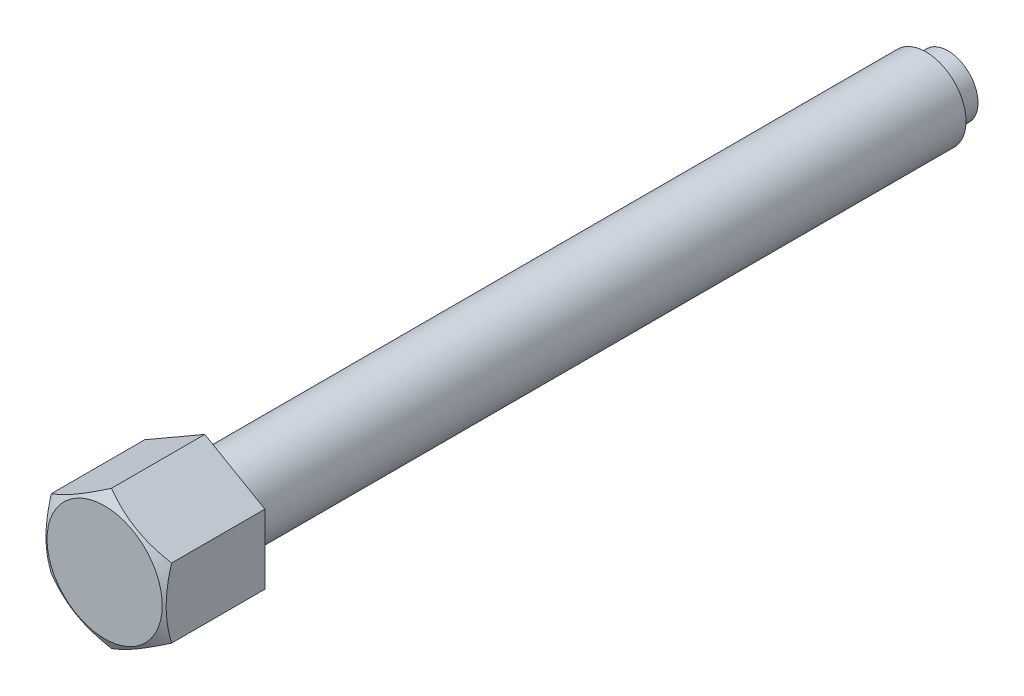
ISO-10303-21;
HEADER;
FILE_DESCRIPTION(('STEP AP214'),'2;1');
FILE_NAME('part.step','',(''),(''),'','','');
FILE_SCHEMA(('AUTOMOTIVE_DESIGN { 1 0 10303 214 1 1 1 1 }'));
ENDSEC;
DATA;
#1=APPLICATION_CONTEXT('core data for automotive mechanical design processes');
#2=APPLICATION_PROTOCOL_DEFINITION('international standard','automotive_design',2000,#1);
#3=PRODUCT_CONTEXT('',#1,'mechanical');
#4=PRODUCT('Part','Part','',(#3));
#5=PRODUCT_RELATED_PRODUCT_CATEGORY('part','',(#4));
#6=PRODUCT_DEFINITION_FORMATION('','',#4);
#7=PRODUCT_DEFINITION_CONTEXT('part definition',#1,'design');
#8=PRODUCT_DEFINITION('design','',#6,#7);
#9=PRODUCT_DEFINITION_SHAPE('','',#8);
#10=(LENGTH_UNIT() NAMED_UNIT(*) SI_UNIT(.MILLI.,.METRE.));
#11=(NAMED_UNIT(*) PLANE_ANGLE_UNIT() SI_UNIT($,.RADIAN.));
#12=(NAMED_UNIT(*) SI_UNIT($,.STERADIAN.) SOLID_ANGLE_UNIT());
#13=UNCERTAINTY_MEASURE_WITH_UNIT(LENGTH_MEASURE(1.E-05),#10,'distance_accuracy_value','');
#14=(GEOMETRIC_REPRESENTATION_CONTEXT(3) GLOBAL_UNCERTAINTY_ASSIGNED_CONTEXT((#13)) GLOBAL_UNIT_ASSIGNED_CONTEXT((#10,
#11,#12)) REPRESENTATION_CONTEXT('',''));
#15=CARTESIAN_POINT('',(0.,0.,0.));
#16=DIRECTION('',(0.,0.,1.));
#17=DIRECTION('',(1.,0.,0.));
#18=AXIS2_PLACEMENT_3D('',#15,#16,#17);
#19=CARTESIAN_POINT('',(0.,13.856406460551,150.));
#20=DIRECTION('',(-0.5,-0.86602540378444,0.));
#21=DIRECTION('',(0.86602540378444,-0.5,0.));
#22=AXIS2_PLACEMENT_3D('',#19,#20,#21);
#23=PLANE('',#22);
#24=CARTESIAN_POINT('',(12.0002,6.92808776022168,168.639461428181));
#25=CARTESIAN_POINT('',(11.7364142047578,7.08038456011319,168.727375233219));
#26=CARTESIAN_POINT('',(11.4716448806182,7.2332492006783,168.811298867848));
#27=CARTESIAN_POINT('',(10.9399829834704,7.54020434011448,168.970058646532));
#28=CARTESIAN_POINT('',(10.673089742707,7.69429522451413,169.044891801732));
#29=CARTESIAN_POINT('',(9.86810959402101,8.15905073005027,169.254307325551));
#30=CARTESIAN_POINT('',(9.32684492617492,8.47155003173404,169.373421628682));
#31=CARTESIAN_POINT('',(8.51686717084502,8.93919090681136,169.513093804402));
#32=CARTESIAN_POINT('',(8.25057389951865,9.09293539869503,169.552881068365));
#33=CARTESIAN_POINT('',(7.71675440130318,9.4011362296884,169.619601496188));
#34=CARTESIAN_POINT('',(7.44922815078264,9.55559258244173,169.646534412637));
#35=CARTESIAN_POINT('',(6.91372963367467,9.86476279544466,169.686856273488));
#36=CARTESIAN_POINT('',(6.64575827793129,10.0194761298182,169.700261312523));
#37=CARTESIAN_POINT('',(6.10956726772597,10.3290461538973,169.713241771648));
#38=CARTESIAN_POINT('',(5.84134762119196,10.4839028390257,169.712817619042));
#39=CARTESIAN_POINT('',(5.33991062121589,10.7734076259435,169.699104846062));
#40=CARTESIAN_POINT('',(5.10665750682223,10.908076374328,169.687488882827));
#41=CARTESIAN_POINT('',(4.64068775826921,11.1771041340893,169.654016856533));
#42=CARTESIAN_POINT('',(4.40797116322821,11.3114631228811,169.632160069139));
#43=CARTESIAN_POINT('',(3.94320092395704,11.5797983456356,169.578587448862));
#44=CARTESIAN_POINT('',(3.71114798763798,11.7137741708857,169.546863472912));
#45=CARTESIAN_POINT('',(3.248130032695,11.9810977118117,169.474113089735));
#46=CARTESIAN_POINT('',(3.01716508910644,12.1144453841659,169.433086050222));
#47=CARTESIAN_POINT('',(2.31605804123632,12.5192297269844,169.295013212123));
#48=CARTESIAN_POINT('',(1.84794625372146,12.789494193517,169.184199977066));
#49=CARTESIAN_POINT('',(0.918702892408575,13.3259930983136,168.932699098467));
#50=CARTESIAN_POINT('',(0.457559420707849,13.5922344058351,168.792070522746));
#51=CARTESIAN_POINT('',(-0.000199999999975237,13.8565219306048,168.639461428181));
#52=B_SPLINE_CURVE_WITH_KNOTS('',3,(#24,#25,#26,#27,#28,#29,#30,#31,#32,#33,#34,#35,#36,#37,#38,
#39,#40,#41,#42,#43,#44,#45,#46,#47,#48,#49,#50,#51),.UNSPECIFIED.,.F.,.F.,(4,2,2,2,2,2,2,2,2,2,
2,2,2,4),(0.,0.951004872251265,1.90232158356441,3.80900466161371,4.73894551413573,
5.66890426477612,6.59775529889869,7.52657763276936,8.33514643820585,9.14377244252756,
9.95306755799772,10.7624176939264,12.4167102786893,14.0677556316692),.UNSPECIFIED.);
#53=CARTESIAN_POINT('',(12.,6.92820323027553,168.639528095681));
#54=VERTEX_POINT('',#53);
#55=CARTESIAN_POINT('',(0.,13.856406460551,168.639528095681));
#56=VERTEX_POINT('',#55);
#57=EDGE_CURVE('E29',#54,#56,#52,.T.);
#58=ORIENTED_EDGE('',*,*,#57,.F.);
#59=DIRECTION('',(0.,0.,1.));
#60=VECTOR('',#59,1.);
#61=CARTESIAN_POINT('',(12.,6.92820323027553,150.));
#62=LINE('',#61,#60);
#63=CARTESIAN_POINT('',(12.,6.92820323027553,150.));
#64=VERTEX_POINT('',#63);
#65=EDGE_CURVE('E22',#64,#54,#62,.T.);
#66=ORIENTED_EDGE('',*,*,#65,.F.);
#67=DIRECTION('',(0.86602540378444,-0.5,0.));
#68=VECTOR('',#67,1.);
#69=CARTESIAN_POINT('',(0.,13.856406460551,150.));
#70=LINE('',#69,#68);
#71=CARTESIAN_POINT('',(0.,13.856406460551,150.));
#72=VERTEX_POINT('',#71);
#73=EDGE_CURVE('E37',#72,#64,#70,.T.);
#74=ORIENTED_EDGE('',*,*,#73,.F.);
#75=DIRECTION('',(0.,0.,1.));
#76=VECTOR('',#75,1.);
#77=CARTESIAN_POINT('',(0.,13.856406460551,150.));
#78=LINE('',#77,#76);
#79=EDGE_CURVE('E87',#72,#56,#78,.T.);
#80=ORIENTED_EDGE('',*,*,#79,.T.);
#81=EDGE_LOOP('',(#58,#66,#74,#80));
#82=FACE_BOUND('',#81,.T.);
#83=ADVANCED_FACE('F14',(#82),#23,.F.);
#84=CARTESIAN_POINT('',(12.,6.92820323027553,150.));
#85=DIRECTION('',(-1.,0.,0.));
#86=DIRECTION('',(0.,0.,1.));
#87=AXIS2_PLACEMENT_3D('',#84,#85,#86);
#88=PLANE('',#87);
#89=CARTESIAN_POINT('',(12.,-18.6520842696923,163.834577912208));
#90=CARTESIAN_POINT('',(12.,-18.3898551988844,163.961899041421));
#91=CARTESIAN_POINT('',(12.,-18.1273195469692,164.088588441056));
#92=CARTESIAN_POINT('',(12.,-17.6015711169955,164.340560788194));
#93=CARTESIAN_POINT('',(12.,-17.3383583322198,164.465843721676));
#94=CARTESIAN_POINT('',(12.,-16.5475388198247,164.839401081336));
#95=CARTESIAN_POINT('',(12.,-16.0188278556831,165.085346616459));
#96=CARTESIAN_POINT('',(12.,-14.9550247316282,165.570863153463));
#97=CARTESIAN_POINT('',(12.,-14.4199135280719,165.810392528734));
#98=CARTESIAN_POINT('',(12.,-13.3454502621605,166.279708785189));
#99=CARTESIAN_POINT('',(12.,-12.8060984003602,166.509496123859));
#100=CARTESIAN_POINT('',(12.,-11.7047322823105,166.96399971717));
#101=CARTESIAN_POINT('',(12.,-11.1425498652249,167.18831059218));
#102=CARTESIAN_POINT('',(12.,-10.011619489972,167.620058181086));
#103=CARTESIAN_POINT('',(12.,-9.44287080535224,167.827493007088));
#104=CARTESIAN_POINT('',(12.,-8.2989724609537,168.220070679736));
#105=CARTESIAN_POINT('',(12.,-7.72383828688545,168.405258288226));
#106=CARTESIAN_POINT('',(12.,-6.56526555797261,168.747437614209));
#107=CARTESIAN_POINT('',(12.,-5.98182966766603,168.904438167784));
#108=CARTESIAN_POINT('',(12.,-5.10195783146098,169.112709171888));
#109=CARTESIAN_POINT('',(12.,-4.80869223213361,169.177453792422));
#110=CARTESIAN_POINT('',(12.,-4.22014933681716,169.297098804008));
#111=CARTESIAN_POINT('',(12.,-3.92487208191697,169.351999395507));
#112=CARTESIAN_POINT('',(12.,-3.33250640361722,169.450989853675));
#113=CARTESIAN_POINT('',(12.,-3.03541800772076,169.495079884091));
#114=CARTESIAN_POINT('',(12.,-2.4397414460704,169.571571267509));
#115=CARTESIAN_POINT('',(12.,-2.14115333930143,169.603973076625));
#116=CARTESIAN_POINT('',(12.,-1.54681202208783,169.656035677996));
#117=CARTESIAN_POINT('',(12.,-1.25107306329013,169.675858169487));
#118=CARTESIAN_POINT('',(12.,-0.659022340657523,169.702976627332));
#119=CARTESIAN_POINT('',(12.,-0.362710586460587,169.71027280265));
#120=CARTESIAN_POINT('',(12.,0.229956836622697,169.712164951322));
#121=CARTESIAN_POINT('',(12.,0.526312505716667,169.706760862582));
#122=CARTESIAN_POINT('',(12.,1.11853118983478,169.683384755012));
#123=CARTESIAN_POINT('',(12.,1.414394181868,169.66541216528));
#124=CARTESIAN_POINT('',(12.,2.12415362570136,169.6076032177));
#125=CARTESIAN_POINT('',(12.,2.537578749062,169.561875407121));
#126=CARTESIAN_POINT('',(12.,3.36139101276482,169.448358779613));
#127=CARTESIAN_POINT('',(12.,3.77177773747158,169.380566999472));
#128=CARTESIAN_POINT('',(12.,4.58911091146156,169.225333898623));
#129=CARTESIAN_POINT('',(12.,4.99605445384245,169.137877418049));
#130=CARTESIAN_POINT('',(12.,5.80587435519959,168.945985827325));
#131=CARTESIAN_POINT('',(12.,6.20875077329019,168.84155096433));
#132=CARTESIAN_POINT('',(12.,7.01935985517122,168.615760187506));
#133=CARTESIAN_POINT('',(12.,7.42700152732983,168.494079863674));
#134=CARTESIAN_POINT('',(12.,8.23826948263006,168.238066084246));
#135=CARTESIAN_POINT('',(12.,8.64189573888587,168.103732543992));
#136=CARTESIAN_POINT('',(12.,9.44533138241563,167.824552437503));
#137=CARTESIAN_POINT('',(12.,9.84514196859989,167.679709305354));
#138=CARTESIAN_POINT('',(12.,10.641444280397,167.381222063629));
#139=CARTESIAN_POINT('',(12.,11.0379360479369,167.227578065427));
#140=CARTESIAN_POINT('',(12.,11.9857392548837,166.85012020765));
#141=CARTESIAN_POINT('',(12.,12.535647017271,166.622786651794));
#142=CARTESIAN_POINT('',(12.,13.630687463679,166.156862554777));
#143=CARTESIAN_POINT('',(12.,14.1758198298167,165.918271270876));
#144=CARTESIAN_POINT('',(12.,15.2622189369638,165.432126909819));
#145=CARTESIAN_POINT('',(12.,15.8034847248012,165.184571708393));
#146=CARTESIAN_POINT('',(12.,16.8826792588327,164.682341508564));
#147=CARTESIAN_POINT('',(12.,17.4206080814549,164.427666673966));
#148=CARTESIAN_POINT('',(12.,18.4943077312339,163.912255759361));
#149=CARTESIAN_POINT('',(12.,19.0300753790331,163.651513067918));
#150=CARTESIAN_POINT('',(12.,20.0992834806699,163.125299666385));
#151=CARTESIAN_POINT('',(12.,20.6327239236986,162.859828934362));
#152=CARTESIAN_POINT('',(12.,21.6975680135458,162.325018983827));
#153=CARTESIAN_POINT('',(12.,22.2289719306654,162.055680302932));
#154=CARTESIAN_POINT('',(12.,23.2901146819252,161.513740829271));
#155=CARTESIAN_POINT('',(12.,23.8198535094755,161.241140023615));
#156=CARTESIAN_POINT('',(12.,25.3159236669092,160.466375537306));
#157=CARTESIAN_POINT('',(12.,26.2805978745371,159.961012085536));
#158=CARTESIAN_POINT('',(12.,28.2063891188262,158.943481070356));
#159=CARTESIAN_POINT('',(12.,29.1675060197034,158.431313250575));
#160=CARTESIAN_POINT('',(12.,31.0844738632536,157.403112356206));
#161=CARTESIAN_POINT('',(12.,32.0403319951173,156.887092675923));
#162=CARTESIAN_POINT('',(12.,33.472447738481,156.110051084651));
#163=CARTESIAN_POINT('',(12.,33.9495276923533,155.850542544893));
#164=CARTESIAN_POINT('',(12.,34.9031943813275,155.330622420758));
#165=CARTESIAN_POINT('',(12.,35.3797811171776,155.070210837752));
#166=CARTESIAN_POINT('',(12.,35.8561494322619,154.809400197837));
#167=B_SPLINE_CURVE_WITH_KNOTS('',3,(#89,#90,#91,#92,#93,#94,#95,#96,#97,#98,#99,#100,#101,#102,
#103,#104,#105,#106,#107,#108,#109,#110,#111,#112,#113,#114,#115,#116,#117,#118,#119,#120,#121,
#122,#123,#124,#125,#126,#127,#128,#129,#130,#131,#132,#133,#134,#135,#136,#137,#138,#139,#140,
#141,#142,#143,#144,#145,#146,#147,#148,#149,#150,#151,#152,#153,#154,#155,#156,#157,#158,#159,
#160,#161,#162,#163,#164,#165,#166),.UNSPECIFIED.,.F.,.F.,(4,2,2,2,2,2,2,2,2,2,2,2,2,2,2,2,2,2,
2,2,2,2,2,2,2,2,2,2,2,2,2,2,2,2,2,2,2,2,4),(0.,0.874511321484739,1.74903135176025,
3.49832805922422,5.25707723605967,7.01574373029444,8.83137823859,10.6472155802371,
12.4593359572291,14.2708872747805,15.1717311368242,16.0725566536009,16.973368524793,
17.8741452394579,18.7630950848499,19.6520301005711,20.5409694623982,21.4299492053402,
22.6770991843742,23.9244167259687,25.1726991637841,26.4209634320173,27.6969627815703,
28.9729706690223,30.2485634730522,31.5241401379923,33.3091044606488,35.0941867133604,
36.8796947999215,38.6651618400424,40.4526749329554,42.2401963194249,44.0274716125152,
45.814753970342,49.0818057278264,52.3489809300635,55.6077204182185,57.2369985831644,
58.8662742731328),.UNSPECIFIED.);
#168=CARTESIAN_POINT('',(12.,-6.92820323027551,168.639528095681));
#169=VERTEX_POINT('',#168);
#170=EDGE_CURVE('E103',#169,#54,#167,.T.);
#171=ORIENTED_EDGE('',*,*,#170,.F.);
#172=DIRECTION('',(0.,0.,1.));
#173=VECTOR('',#172,1.);
#174=CARTESIAN_POINT('',(12.,-6.9282032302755,150.));
#175=LINE('',#174,#173);
#176=CARTESIAN_POINT('',(12.,-6.9282032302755,150.));
#177=VERTEX_POINT('',#176);
#178=EDGE_CURVE('E96',#177,#169,#175,.T.);
#179=ORIENTED_EDGE('',*,*,#178,.F.);
#180=DIRECTION('',(0.,-1.,0.));
#181=VECTOR('',#180,1.);
#182=CARTESIAN_POINT('',(12.,6.92820323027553,150.));
#183=LINE('',#182,#181);
#184=EDGE_CURVE('E105',#64,#177,#183,.T.);
#185=ORIENTED_EDGE('',*,*,#184,.F.);
#186=ORIENTED_EDGE('',*,*,#65,.T.);
#187=EDGE_LOOP('',(#171,#179,#185,#186));
#188=FACE_BOUND('',#187,.T.);
#189=ADVANCED_FACE('F102',(#188),#88,.F.);
#190=CARTESIAN_POINT('',(0.,-13.856406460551,150.));
#191=DIRECTION('',(0.5,-0.866025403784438,0.));
#192=DIRECTION('',(0.866025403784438,0.5,0.));
#193=AXIS2_PLACEMENT_3D('',#190,#191,#192);
#194=PLANE('',#193);
#195=ORIENTED_EDGE('',*,*,#178,.T.);
#196=CARTESIAN_POINT('',(12.0002,-6.92808776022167,168.639461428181));
#197=CARTESIAN_POINT('',(11.7364142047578,-7.08038456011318,168.727375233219));
#198=CARTESIAN_POINT('',(11.4716448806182,-7.23324920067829,168.811298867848));
#199=CARTESIAN_POINT('',(10.9399829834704,-7.54020434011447,168.970058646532));
#200=CARTESIAN_POINT('',(10.673089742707,-7.69429522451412,169.044891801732));
#201=CARTESIAN_POINT('',(9.86810959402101,-8.15905073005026,169.254307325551));
#202=CARTESIAN_POINT('',(9.32684492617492,-8.47155003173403,169.373421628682));
#203=CARTESIAN_POINT('',(8.51686717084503,-8.93919090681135,169.513093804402));
#204=CARTESIAN_POINT('',(8.25057389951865,-9.09293539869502,169.552881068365));
#205=CARTESIAN_POINT('',(7.71675440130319,-9.4011362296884,169.619601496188));
#206=CARTESIAN_POINT('',(7.44922815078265,-9.55559258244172,169.646534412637));
#207=CARTESIAN_POINT('',(6.91372963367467,-9.86476279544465,169.686856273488));
#208=CARTESIAN_POINT('',(6.64575827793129,-10.0194761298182,169.700261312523));
#209=CARTESIAN_POINT('',(6.10956726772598,-10.3290461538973,169.713241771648));
#210=CARTESIAN_POINT('',(5.84134762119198,-10.4839028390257,169.712817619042));
#211=CARTESIAN_POINT('',(5.3399106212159,-10.7734076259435,169.699104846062));
#212=CARTESIAN_POINT('',(5.10665750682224,-10.908076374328,169.687488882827));
#213=CARTESIAN_POINT('',(4.64068775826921,-11.1771041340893,169.654016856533));
#214=CARTESIAN_POINT('',(4.40797116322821,-11.3114631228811,169.632160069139));
#215=CARTESIAN_POINT('',(3.94320092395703,-11.5797983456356,169.578587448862));
#216=CARTESIAN_POINT('',(3.71114798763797,-11.7137741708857,169.546863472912));
#217=CARTESIAN_POINT('',(3.24813003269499,-11.9810977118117,169.474113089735));
#218=CARTESIAN_POINT('',(3.01716508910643,-12.1144453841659,169.433086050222));
#219=CARTESIAN_POINT('',(2.31605804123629,-12.5192297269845,169.295013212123));
#220=CARTESIAN_POINT('',(1.84794625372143,-12.789494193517,169.184199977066));
#221=CARTESIAN_POINT('',(0.91870289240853,-13.3259930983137,168.932699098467));
#222=CARTESIAN_POINT('',(0.457559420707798,-13.5922344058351,168.792070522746));
#223=CARTESIAN_POINT('',(-0.000200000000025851,-13.8565219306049,168.639461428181));
#224=B_SPLINE_CURVE_WITH_KNOTS('',3,(#196,#197,#198,#199,#200,#201,#202,#203,#204,#205,#206,
#207,#208,#209,#210,#211,#212,#213,#214,#215,#216,#217,#218,#219,#220,#221,#222,#223),
.UNSPECIFIED.,.F.,.F.,(4,2,2,2,2,2,2,2,2,2,2,2,2,4),(0.,0.951004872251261,1.9023215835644,
3.80900466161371,4.73894551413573,5.66890426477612,6.59775529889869,7.52657763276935,
8.33514643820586,9.14377244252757,9.95306755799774,10.7624176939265,12.4167102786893,
14.0677556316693),.UNSPECIFIED.);
#225=CARTESIAN_POINT('',(0.,-13.856406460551,168.639528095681));
#226=VERTEX_POINT('',#225);
#227=EDGE_CURVE('E107',#169,#226,#224,.T.);
#228=ORIENTED_EDGE('',*,*,#227,.T.);
#229=DIRECTION('',(0.,0.,1.));
#230=VECTOR('',#229,1.);
#231=CARTESIAN_POINT('',(0.,-13.856406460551,150.));
#232=LINE('',#231,#230);
#233=CARTESIAN_POINT('',(0.,-13.856406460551,150.));
#234=VERTEX_POINT('',#233);
#235=EDGE_CURVE('E89',#234,#226,#232,.T.);
#236=ORIENTED_EDGE('',*,*,#235,.F.);
#237=DIRECTION('',(0.866025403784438,0.5,0.));
#238=VECTOR('',#237,1.);
#239=CARTESIAN_POINT('',(0.,-13.856406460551,150.));
#240=LINE('',#239,#238);
#241=EDGE_CURVE('E298',#234,#177,#240,.T.);
#242=ORIENTED_EDGE('',*,*,#241,.T.);
#243=EDGE_LOOP('',(#195,#228,#236,#242));
#244=FACE_BOUND('',#243,.T.);
#245=ADVANCED_FACE('F160',(#244),#194,.T.);
#246=CARTESIAN_POINT('',(0.,-13.856406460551,150.));
#247=DIRECTION('',(0.5,0.866025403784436,0.));
#248=DIRECTION('',(-0.866025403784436,0.5,0.));
#249=AXIS2_PLACEMENT_3D('',#246,#247,#248);
#250=PLANE('',#249);
#251=CARTESIAN_POINT('',(-12.0002,-6.92808776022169,168.639461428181));
#252=CARTESIAN_POINT('',(-11.7364142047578,-7.08038456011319,168.727375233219));
#253=CARTESIAN_POINT('',(-11.4716448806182,-7.23324920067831,168.811298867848));
#254=CARTESIAN_POINT('',(-10.9399829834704,-7.54020434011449,168.970058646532));
#255=CARTESIAN_POINT('',(-10.673089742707,-7.69429522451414,169.044891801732));
#256=CARTESIAN_POINT('',(-9.86810959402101,-8.15905073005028,169.254307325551));
#257=CARTESIAN_POINT('',(-9.32684492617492,-8.47155003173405,169.373421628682));
#258=CARTESIAN_POINT('',(-8.51686717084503,-8.93919090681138,169.513093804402));
#259=CARTESIAN_POINT('',(-8.25057389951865,-9.09293539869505,169.552881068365));
#260=CARTESIAN_POINT('',(-7.71675440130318,-9.40113622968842,169.619601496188));
#261=CARTESIAN_POINT('',(-7.44922815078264,-9.55559258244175,169.646534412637));
#262=CARTESIAN_POINT('',(-6.91372963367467,-9.86476279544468,169.686856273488));
#263=CARTESIAN_POINT('',(-6.64575827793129,-10.0194761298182,169.700261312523));
#264=CARTESIAN_POINT('',(-6.10956726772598,-10.3290461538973,169.713241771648));
#265=CARTESIAN_POINT('',(-5.84134762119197,-10.4839028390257,169.712817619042));
#266=CARTESIAN_POINT('',(-5.3399106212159,-10.7734076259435,169.699104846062));
#267=CARTESIAN_POINT('',(-5.10665750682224,-10.908076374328,169.687488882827));
#268=CARTESIAN_POINT('',(-4.64068775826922,-11.1771041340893,169.654016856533));
#269=CARTESIAN_POINT('',(-4.40797116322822,-11.3114631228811,169.632160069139));
#270=CARTESIAN_POINT('',(-3.94320092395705,-11.5797983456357,169.578587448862));
#271=CARTESIAN_POINT('',(-3.71114798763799,-11.7137741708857,169.546863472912));
#272=CARTESIAN_POINT('',(-3.24813003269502,-11.9810977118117,169.474113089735));
#273=CARTESIAN_POINT('',(-3.01716508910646,-12.1144453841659,169.433086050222));
#274=CARTESIAN_POINT('',(-2.31605804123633,-12.5192297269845,169.295013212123));
#275=CARTESIAN_POINT('',(-1.84794625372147,-12.789494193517,169.184199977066));
#276=CARTESIAN_POINT('',(-0.918702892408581,-13.3259930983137,168.932699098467));
#277=CARTESIAN_POINT('',(-0.457559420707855,-13.5922344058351,168.792070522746));
#278=CARTESIAN_POINT('',(0.00019999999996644,-13.8565219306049,168.639461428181));
#279=B_SPLINE_CURVE_WITH_KNOTS('',3,(#251,#252,#253,#254,#255,#256,#257,#258,#259,#260,#261,
#262,#263,#264,#265,#266,#267,#268,#269,#270,#271,#272,#273,#274,#275,#276,#277,#278),
.UNSPECIFIED.,.F.,.F.,(4,2,2,2,2,2,2,2,2,2,2,2,2,4),(0.,0.951004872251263,1.90232158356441,
3.80900466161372,4.73894551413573,5.66890426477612,6.59775529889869,7.52657763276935,
8.33514643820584,9.14377244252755,9.95306755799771,10.7624176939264,12.4167102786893,
14.0677556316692),.UNSPECIFIED.);
#280=CARTESIAN_POINT('',(-12.,-6.92820323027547,168.639528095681));
#281=VERTEX_POINT('',#280);
#282=EDGE_CURVE('E81',#281,#226,#279,.T.);
#283=ORIENTED_EDGE('',*,*,#282,.F.);
#284=DIRECTION('',(0.,0.,1.));
#285=VECTOR('',#284,1.);
#286=CARTESIAN_POINT('',(-12.,-6.92820323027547,150.));
#287=LINE('',#286,#285);
#288=CARTESIAN_POINT('',(-12.,-6.92820323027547,150.));
#289=VERTEX_POINT('',#288);
#290=EDGE_CURVE('E80',#289,#281,#287,.T.);
#291=ORIENTED_EDGE('',*,*,#290,.F.);
#292=DIRECTION('',(-0.866025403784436,0.5,0.));
#293=VECTOR('',#292,1.);
#294=CARTESIAN_POINT('',(0.,-13.856406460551,150.));
#295=LINE('',#294,#293);
#296=EDGE_CURVE('E300',#234,#289,#295,.T.);
#297=ORIENTED_EDGE('',*,*,#296,.F.);
#298=ORIENTED_EDGE('',*,*,#235,.T.);
#299=EDGE_LOOP('',(#283,#291,#297,#298));
#300=FACE_BOUND('',#299,.T.);
#301=ADVANCED_FACE('F163',(#300),#250,.F.);
#302=CARTESIAN_POINT('',(-12.,6.92820323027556,150.));
#303=DIRECTION('',(-1.,0.,0.));
#304=DIRECTION('',(0.,0.,1.));
#305=AXIS2_PLACEMENT_3D('',#302,#303,#304);
#306=PLANE('',#305);
#307=ORIENTED_EDGE('',*,*,#290,.T.);
#308=CARTESIAN_POINT('',(-12.,-18.6520842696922,163.834577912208));
#309=CARTESIAN_POINT('',(-12.,-18.3898551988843,163.961899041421));
#310=CARTESIAN_POINT('',(-12.,-18.1273195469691,164.088588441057));
#311=CARTESIAN_POINT('',(-12.,-17.6015711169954,164.340560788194));
#312=CARTESIAN_POINT('',(-12.,-17.3383583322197,164.465843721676));
#313=CARTESIAN_POINT('',(-12.,-16.5475388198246,164.839401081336));
#314=CARTESIAN_POINT('',(-12.,-16.018827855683,165.085346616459));
#315=CARTESIAN_POINT('',(-12.,-14.9550247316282,165.570863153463));
#316=CARTESIAN_POINT('',(-12.,-14.4199135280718,165.810392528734));
#317=CARTESIAN_POINT('',(-12.,-13.3454502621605,166.279708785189));
#318=CARTESIAN_POINT('',(-12.,-12.8060984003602,166.509496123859));
#319=CARTESIAN_POINT('',(-12.,-11.7047322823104,166.96399971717));
#320=CARTESIAN_POINT('',(-12.,-11.1425498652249,167.18831059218));
#321=CARTESIAN_POINT('',(-12.,-10.0116194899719,167.620058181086));
#322=CARTESIAN_POINT('',(-12.,-9.44287080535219,167.827493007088));
#323=CARTESIAN_POINT('',(-12.,-8.29897246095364,168.220070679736));
#324=CARTESIAN_POINT('',(-12.,-7.7238382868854,168.405258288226));
#325=CARTESIAN_POINT('',(-12.,-6.56526555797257,168.747437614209));
#326=CARTESIAN_POINT('',(-12.,-5.98182966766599,168.904438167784));
#327=CARTESIAN_POINT('',(-12.,-5.10195783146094,169.112709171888));
#328=CARTESIAN_POINT('',(-12.,-4.80869223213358,169.177453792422));
#329=CARTESIAN_POINT('',(-12.,-4.22014933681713,169.297098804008));
#330=CARTESIAN_POINT('',(-12.,-3.92487208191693,169.351999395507));
#331=CARTESIAN_POINT('',(-12.,-3.33250640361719,169.450989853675));
#332=CARTESIAN_POINT('',(-12.,-3.03541800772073,169.495079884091));
#333=CARTESIAN_POINT('',(-12.,-2.43974144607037,169.571571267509));
#334=CARTESIAN_POINT('',(-12.,-2.1411533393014,169.603973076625));
#335=CARTESIAN_POINT('',(-12.,-1.5468120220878,169.656035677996));
#336=CARTESIAN_POINT('',(-12.,-1.2510730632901,169.675858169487));
#337=CARTESIAN_POINT('',(-12.,-0.659022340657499,169.702976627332));
#338=CARTESIAN_POINT('',(-12.,-0.362710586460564,169.71027280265));
#339=CARTESIAN_POINT('',(-12.,0.229956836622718,169.712164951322));
#340=CARTESIAN_POINT('',(-12.,0.526312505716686,169.706760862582));
#341=CARTESIAN_POINT('',(-12.,1.1185311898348,169.683384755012));
#342=CARTESIAN_POINT('',(-12.,1.41439418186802,169.66541216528));
#343=CARTESIAN_POINT('',(-12.,2.12415362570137,169.6076032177));
#344=CARTESIAN_POINT('',(-12.,2.53757874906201,169.561875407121));
#345=CARTESIAN_POINT('',(-12.,3.36139101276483,169.448358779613));
#346=CARTESIAN_POINT('',(-12.,3.7717777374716,169.380566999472));
#347=CARTESIAN_POINT('',(-12.,4.58911091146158,169.225333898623));
#348=CARTESIAN_POINT('',(-12.,4.99605445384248,169.137877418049));
#349=CARTESIAN_POINT('',(-12.,5.80587435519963,168.945985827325));
#350=CARTESIAN_POINT('',(-12.,6.20875077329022,168.84155096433));
#351=CARTESIAN_POINT('',(-12.,7.01935985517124,168.615760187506));
#352=CARTESIAN_POINT('',(-12.,7.42700152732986,168.494079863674));
#353=CARTESIAN_POINT('',(-12.,8.23826948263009,168.238066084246));
#354=CARTESIAN_POINT('',(-12.,8.64189573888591,168.103732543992));
#355=CARTESIAN_POINT('',(-12.,9.44533138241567,167.824552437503));
#356=CARTESIAN_POINT('',(-12.,9.84514196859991,167.679709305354));
#357=CARTESIAN_POINT('',(-12.,10.6414442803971,167.381222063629));
#358=CARTESIAN_POINT('',(-12.,11.037936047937,167.227578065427));
#359=CARTESIAN_POINT('',(-12.,11.9857392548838,166.85012020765));
#360=CARTESIAN_POINT('',(-12.,12.535647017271,166.622786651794));
#361=CARTESIAN_POINT('',(-12.,13.630687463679,166.156862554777));
#362=CARTESIAN_POINT('',(-12.,14.1758198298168,165.918271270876));
#363=CARTESIAN_POINT('',(-12.,15.2622189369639,165.432126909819));
#364=CARTESIAN_POINT('',(-12.,15.8034847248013,165.184571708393));
#365=CARTESIAN_POINT('',(-12.,16.8826792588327,164.682341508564));
#366=CARTESIAN_POINT('',(-12.,17.4206080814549,164.427666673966));
#367=CARTESIAN_POINT('',(-12.,18.494307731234,163.912255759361));
#368=CARTESIAN_POINT('',(-12.,19.0300753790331,163.651513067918));
#369=CARTESIAN_POINT('',(-12.,20.0992834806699,163.125299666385));
#370=CARTESIAN_POINT('',(-12.,20.6327239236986,162.859828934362));
#371=CARTESIAN_POINT('',(-12.,21.6975680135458,162.325018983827));
#372=CARTESIAN_POINT('',(-12.,22.2289719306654,162.055680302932));
#373=CARTESIAN_POINT('',(-12.,23.2901146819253,161.513740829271));
#374=CARTESIAN_POINT('',(-12.,23.8198535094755,161.241140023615));
#375=CARTESIAN_POINT('',(-12.,25.3159236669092,160.466375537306));
#376=CARTESIAN_POINT('',(-12.,26.2805978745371,159.961012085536));
#377=CARTESIAN_POINT('',(-12.,28.2063891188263,158.943481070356));
#378=CARTESIAN_POINT('',(-12.,29.1675060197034,158.431313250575));
#379=CARTESIAN_POINT('',(-12.,31.0844738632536,157.403112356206));
#380=CARTESIAN_POINT('',(-12.,32.0403319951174,156.887092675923));
#381=CARTESIAN_POINT('',(-12.,33.472447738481,156.11005108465));
#382=CARTESIAN_POINT('',(-12.,33.9495276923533,155.850542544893));
#383=CARTESIAN_POINT('',(-12.,34.9031943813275,155.330622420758));
#384=CARTESIAN_POINT('',(-12.,35.3797811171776,155.070210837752));
#385=CARTESIAN_POINT('',(-12.,35.856149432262,154.809400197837));
#386=B_SPLINE_CURVE_WITH_KNOTS('',3,(#308,#309,#310,#311,#312,#313,#314,#315,#316,#317,#318,
#319,#320,#321,#322,#323,#324,#325,#326,#327,#328,#329,#330,#331,#332,#333,#334,#335,#336,#337,
#338,#339,#340,#341,#342,#343,#344,#345,#346,#347,#348,#349,#350,#351,#352,#353,#354,#355,#356,
#357,#358,#359,#360,#361,#362,#363,#364,#365,#366,#367,#368,#369,#370,#371,#372,#373,#374,#375,
#376,#377,#378,#379,#380,#381,#382,#383,#384,#385),.UNSPECIFIED.,.F.,.F.,(4,2,2,2,2,2,2,2,2,2,2,
2,2,2,2,2,2,2,2,2,2,2,2,2,2,2,2,2,2,2,2,2,2,2,2,2,2,2,4),(0.,0.874511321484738,1.74903135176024,
3.4983280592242,5.25707723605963,7.01574373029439,8.83137823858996,10.6472155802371,
12.4593359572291,14.2708872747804,15.1717311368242,16.0725566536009,16.973368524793,
17.8741452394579,18.7630950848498,19.652030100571,20.5409694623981,21.4299492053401,
22.6770991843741,23.9244167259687,25.1726991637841,26.4209634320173,27.6969627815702,
28.9729706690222,30.2485634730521,31.5241401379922,33.3091044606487,35.0941867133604,
36.8796947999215,38.6651618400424,40.4526749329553,42.2401963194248,44.0274716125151,
45.814753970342,49.0818057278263,52.3489809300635,55.6077204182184,57.2369985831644,
58.8662742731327),.UNSPECIFIED.);
#387=CARTESIAN_POINT('',(-12.,6.92820323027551,168.639528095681));
#388=VERTEX_POINT('',#387);
#389=EDGE_CURVE('E68',#281,#388,#386,.T.);
#390=ORIENTED_EDGE('',*,*,#389,.T.);
#391=DIRECTION('',(0.,0.,1.));
#392=VECTOR('',#391,1.);
#393=CARTESIAN_POINT('',(-12.,6.92820323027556,150.));
#394=LINE('',#393,#392);
#395=CARTESIAN_POINT('',(-12.,6.92820323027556,150.));
#396=VERTEX_POINT('',#395);
#397=EDGE_CURVE('E78',#396,#388,#394,.T.);
#398=ORIENTED_EDGE('',*,*,#397,.F.);
#399=DIRECTION('',(0.,-1.,0.));
#400=VECTOR('',#399,1.);
#401=CARTESIAN_POINT('',(-12.,6.92820323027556,150.));
#402=LINE('',#401,#400);
#403=EDGE_CURVE('E304',#396,#289,#402,.T.);
#404=ORIENTED_EDGE('',*,*,#403,.T.);
#405=EDGE_LOOP('',(#307,#390,#398,#404));
#406=FACE_BOUND('',#405,.T.);
#407=ADVANCED_FACE('F76',(#406),#306,.T.);
#408=CARTESIAN_POINT('',(0.,13.856406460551,150.));
#409=DIRECTION('',(-0.5,0.866025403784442,0.));
#410=DIRECTION('',(-0.866025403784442,-0.5,0.));
#411=AXIS2_PLACEMENT_3D('',#408,#409,#410);
#412=PLANE('',#411);
#413=ORIENTED_EDGE('',*,*,#397,.T.);
#414=CARTESIAN_POINT('',(-12.0002,6.92808776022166,168.639461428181));
#415=CARTESIAN_POINT('',(-11.7364142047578,7.08038456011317,168.727375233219));
#416=CARTESIAN_POINT('',(-11.4716448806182,7.23324920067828,168.811298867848));
#417=CARTESIAN_POINT('',(-10.9399829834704,7.54020434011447,168.970058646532));
#418=CARTESIAN_POINT('',(-10.6730897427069,7.69429522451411,169.044891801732));
#419=CARTESIAN_POINT('',(-9.868109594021,8.15905073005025,169.254307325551));
#420=CARTESIAN_POINT('',(-9.32684492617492,8.47155003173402,169.373421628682));
#421=CARTESIAN_POINT('',(-8.51686717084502,8.93919090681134,169.513093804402));
#422=CARTESIAN_POINT('',(-8.25057389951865,9.09293539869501,169.552881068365));
#423=CARTESIAN_POINT('',(-7.71675440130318,9.40113622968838,169.619601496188));
#424=CARTESIAN_POINT('',(-7.44922815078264,9.5555925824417,169.646534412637));
#425=CARTESIAN_POINT('',(-6.91372963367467,9.86476279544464,169.686856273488));
#426=CARTESIAN_POINT('',(-6.64575827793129,10.0194761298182,169.700261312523));
#427=CARTESIAN_POINT('',(-6.10956726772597,10.3290461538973,169.713241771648));
#428=CARTESIAN_POINT('',(-5.84134762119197,10.4839028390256,169.712817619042));
#429=CARTESIAN_POINT('',(-5.33991062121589,10.7734076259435,169.699104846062));
#430=CARTESIAN_POINT('',(-5.10665750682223,10.908076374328,169.687488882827));
#431=CARTESIAN_POINT('',(-4.6406877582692,11.1771041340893,169.654016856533));
#432=CARTESIAN_POINT('',(-4.4079711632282,11.3114631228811,169.632160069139));
#433=CARTESIAN_POINT('',(-3.94320092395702,11.5797983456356,169.578587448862));
#434=CARTESIAN_POINT('',(-3.71114798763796,11.7137741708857,169.546863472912));
#435=CARTESIAN_POINT('',(-3.24813003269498,11.9810977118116,169.474113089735));
#436=CARTESIAN_POINT('',(-3.01716508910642,12.1144453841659,169.433086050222));
#437=CARTESIAN_POINT('',(-2.31605804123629,12.5192297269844,169.295013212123));
#438=CARTESIAN_POINT('',(-1.84794625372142,12.789494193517,169.184199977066));
#439=CARTESIAN_POINT('',(-0.918702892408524,13.3259930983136,168.932699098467));
#440=CARTESIAN_POINT('',(-0.457559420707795,13.5922344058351,168.792070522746));
#441=CARTESIAN_POINT('',(0.00020000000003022,13.8565219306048,168.639461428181));
#442=B_SPLINE_CURVE_WITH_KNOTS('',3,(#414,#415,#416,#417,#418,#419,#420,#421,#422,#423,#424,
#425,#426,#427,#428,#429,#430,#431,#432,#433,#434,#435,#436,#437,#438,#439,#440,#441),
.UNSPECIFIED.,.F.,.F.,(4,2,2,2,2,2,2,2,2,2,2,2,2,4),(0.,0.951004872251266,1.90232158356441,
3.80900466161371,4.73894551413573,5.66890426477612,6.59775529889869,7.52657763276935,
8.33514643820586,9.14377244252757,9.95306755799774,10.7624176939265,12.4167102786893,
14.0677556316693),.UNSPECIFIED.);
#443=EDGE_CURVE('E65',#388,#56,#442,.T.);
#444=ORIENTED_EDGE('',*,*,#443,.T.);
#445=ORIENTED_EDGE('',*,*,#79,.F.);
#446=DIRECTION('',(-0.866025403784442,-0.5,0.));
#447=VECTOR('',#446,1.);
#448=CARTESIAN_POINT('',(0.,13.856406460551,150.));
#449=LINE('',#448,#447);
#450=EDGE_CURVE('E85',#72,#396,#449,.T.);
#451=ORIENTED_EDGE('',*,*,#450,.T.);
#452=EDGE_LOOP('',(#413,#444,#445,#451));
#453=FACE_BOUND('',#452,.T.);
#454=ADVANCED_FACE('F83',(#453),#412,.T.);
#455=CARTESIAN_POINT('',(0.,0.,135.));
#456=DIRECTION('',(0.,0.,1.));
#457=DIRECTION('',(1.,0.,0.));
#458=AXIS2_PLACEMENT_3D('',#455,#456,#457);
#459=CYLINDRICAL_SURFACE('',#458,8.);
#460=CARTESIAN_POINT('',(0.,0.,150.));
#461=DIRECTION('',(0.,0.,1.));
#462=DIRECTION('',(1.,0.,0.));
#463=AXIS2_PLACEMENT_3D('',#460,#461,#462);
#464=CIRCLE('',#463,8.);
#465=CARTESIAN_POINT('',(8.,0.,150.));
#466=VERTEX_POINT('',#465);
#467=EDGE_CURVE('E9',#466,#466,#464,.T.);
#468=ORIENTED_EDGE('',*,*,#467,.F.);
#469=EDGE_LOOP('',(#468));
#470=FACE_BOUND('',#469,.T.);
#471=CARTESIAN_POINT('',(0.,0.,6.));
#472=DIRECTION('',(0.,0.,1.));
#473=DIRECTION('',(1.,0.,0.));
#474=AXIS2_PLACEMENT_3D('',#471,#472,#473);
#475=CIRCLE('',#474,8.);
#476=CARTESIAN_POINT('',(8.,0.,6.));
#477=VERTEX_POINT('',#476);
#478=EDGE_CURVE('E273',#477,#477,#475,.T.);
#479=ORIENTED_EDGE('',*,*,#478,.T.);
#480=EDGE_LOOP('',(#479));
#481=FACE_BOUND('',#480,.T.);
#482=ADVANCED_FACE('F16',(#470,#481),#459,.T.);
#483=CARTESIAN_POINT('',(8.,0.,150.));
#484=DIRECTION('',(0.,0.,1.));
#485=DIRECTION('',(1.,0.,0.));
#486=AXIS2_PLACEMENT_3D('',#483,#484,#485);
#487=PLANE('',#486);
#488=ORIENTED_EDGE('',*,*,#450,.F.);
#489=ORIENTED_EDGE('',*,*,#73,.T.);
#490=ORIENTED_EDGE('',*,*,#184,.T.);
#491=ORIENTED_EDGE('',*,*,#241,.F.);
#492=ORIENTED_EDGE('',*,*,#296,.T.);
#493=ORIENTED_EDGE('',*,*,#403,.F.);
#494=EDGE_LOOP('',(#488,#489,#490,#491,#492,#493));
#495=FACE_BOUND('',#494,.T.);
#496=ORIENTED_EDGE('',*,*,#467,.T.);
#497=EDGE_LOOP('',(#496));
#498=FACE_BOUND('',#497,.T.);
#499=ADVANCED_FACE('F129',(#495,#498),#487,.F.);
#500=CARTESIAN_POINT('',(0.,0.,170.));
#501=DIRECTION('',(0.,0.,-1.));
#502=DIRECTION('',(-1.,0.,0.));
#503=AXIS2_PLACEMENT_3D('',#500,#501,#502);
#504=CONICAL_SURFACE('',#503,11.5,1.0471975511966);
#505=CARTESIAN_POINT('',(0.,0.,170.));
#506=DIRECTION('',(0.,0.,1.));
#507=DIRECTION('',(1.,0.,0.));
#508=AXIS2_PLACEMENT_3D('',#505,#506,#507);
#509=CIRCLE('',#508,11.5);
#510=CARTESIAN_POINT('',(11.5,0.,170.));
#511=VERTEX_POINT('',#510);
#512=EDGE_CURVE('E72',#511,#511,#509,.T.);
#513=ORIENTED_EDGE('',*,*,#512,.F.);
#514=EDGE_LOOP('',(#513));
#515=FACE_BOUND('',#514,.T.);
#516=ORIENTED_EDGE('',*,*,#57,.T.);
#517=ORIENTED_EDGE('',*,*,#443,.F.);
#518=ORIENTED_EDGE('',*,*,#389,.F.);
#519=ORIENTED_EDGE('',*,*,#282,.T.);
#520=ORIENTED_EDGE('',*,*,#227,.F.);
#521=ORIENTED_EDGE('',*,*,#170,.T.);
#522=EDGE_LOOP('',(#516,#517,#518,#519,#520,#521));
#523=FACE_BOUND('',#522,.T.);
#524=ADVANCED_FACE('F67',(#515,#523),#504,.T.);
#525=CARTESIAN_POINT('',(0.,0.,170.));
#526=DIRECTION('',(0.,0.,1.));
#527=DIRECTION('',(1.,0.,0.));
#528=AXIS2_PLACEMENT_3D('',#525,#526,#527);
#529=PLANE('',#528);
#530=ORIENTED_EDGE('',*,*,#512,.T.);
#531=EDGE_LOOP('',(#530));
#532=FACE_BOUND('',#531,.T.);
#533=ADVANCED_FACE('F128',(#532),#529,.T.);
#534=CARTESIAN_POINT('',(0.,0.,12.));
#535=DIRECTION('',(0.,0.,1.));
#536=DIRECTION('',(0.,1.,0.));
#537=AXIS2_PLACEMENT_3D('',#534,#535,#536);
#538=SPHERICAL_SURFACE('',#537,12.);
#539=CARTESIAN_POINT('',(0.,0.,1.60769515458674));
#540=DIRECTION('',(0.,0.,1.));
#541=DIRECTION('',(1.,0.,0.));
#542=AXIS2_PLACEMENT_3D('',#539,#540,#541);
#543=CIRCLE('',#542,6.);
#544=CARTESIAN_POINT('',(6.,0.,1.60769515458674));
#545=VERTEX_POINT('',#544);
#546=EDGE_CURVE('E277',#545,#545,#543,.T.);
#547=ORIENTED_EDGE('',*,*,#546,.F.);
#548=EDGE_LOOP('',(#547));
#549=FACE_BOUND('',#548,.T.);
#550=ADVANCED_FACE('F131',(#549),#538,.T.);
#551=CARTESIAN_POINT('',(0.,0.,58.2601270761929));
#552=DIRECTION('',(0.,0.,1.));
#553=DIRECTION('',(1.,0.,0.));
#554=AXIS2_PLACEMENT_3D('',#551,#552,#553);
#555=CYLINDRICAL_SURFACE('',#554,6.);
#556=CARTESIAN_POINT('',(0.,0.,6.));
#557=DIRECTION('',(0.,0.,1.));
#558=DIRECTION('',(1.,0.,0.));
#559=AXIS2_PLACEMENT_3D('',#556,#557,#558);
#560=CIRCLE('',#559,6.);
#561=CARTESIAN_POINT('',(6.,0.,6.));
#562=VERTEX_POINT('',#561);
#563=EDGE_CURVE('E276',#562,#562,#560,.T.);
#564=ORIENTED_EDGE('',*,*,#563,.F.);
#565=EDGE_LOOP('',(#564));
#566=FACE_BOUND('',#565,.T.);
#567=ORIENTED_EDGE('',*,*,#546,.T.);
#568=EDGE_LOOP('',(#567));
#569=FACE_BOUND('',#568,.T.);
#570=ADVANCED_FACE('F247',(#566,#569),#555,.T.);
#571=CARTESIAN_POINT('',(0.,8.,6.));
#572=DIRECTION('',(0.,0.,1.));
#573=DIRECTION('',(1.,0.,0.));
#574=AXIS2_PLACEMENT_3D('',#571,#572,#573);
#575=PLANE('',#574);
#576=ORIENTED_EDGE('',*,*,#478,.F.);
#577=EDGE_LOOP('',(#576));
#578=FACE_BOUND('',#577,.T.);
#579=ORIENTED_EDGE('',*,*,#563,.T.);
#580=EDGE_LOOP('',(#579));
#581=FACE_BOUND('',#580,.T.);
#582=ADVANCED_FACE('F256',(#578,#581),#575,.F.);
#583=CLOSED_SHELL('',(#83,#189,#245,#301,#407,#454,#482,#499,#524,#533,#550,#570,#582));
#584=MANIFOLD_SOLID_BREP('B1',#583);
#585=ADVANCED_BREP_SHAPE_REPRESENTATION('',(#18,#584),#14);
#586=SHAPE_DEFINITION_REPRESENTATION(#9,#585);
ENDSEC;
END-ISO-10303-21;
